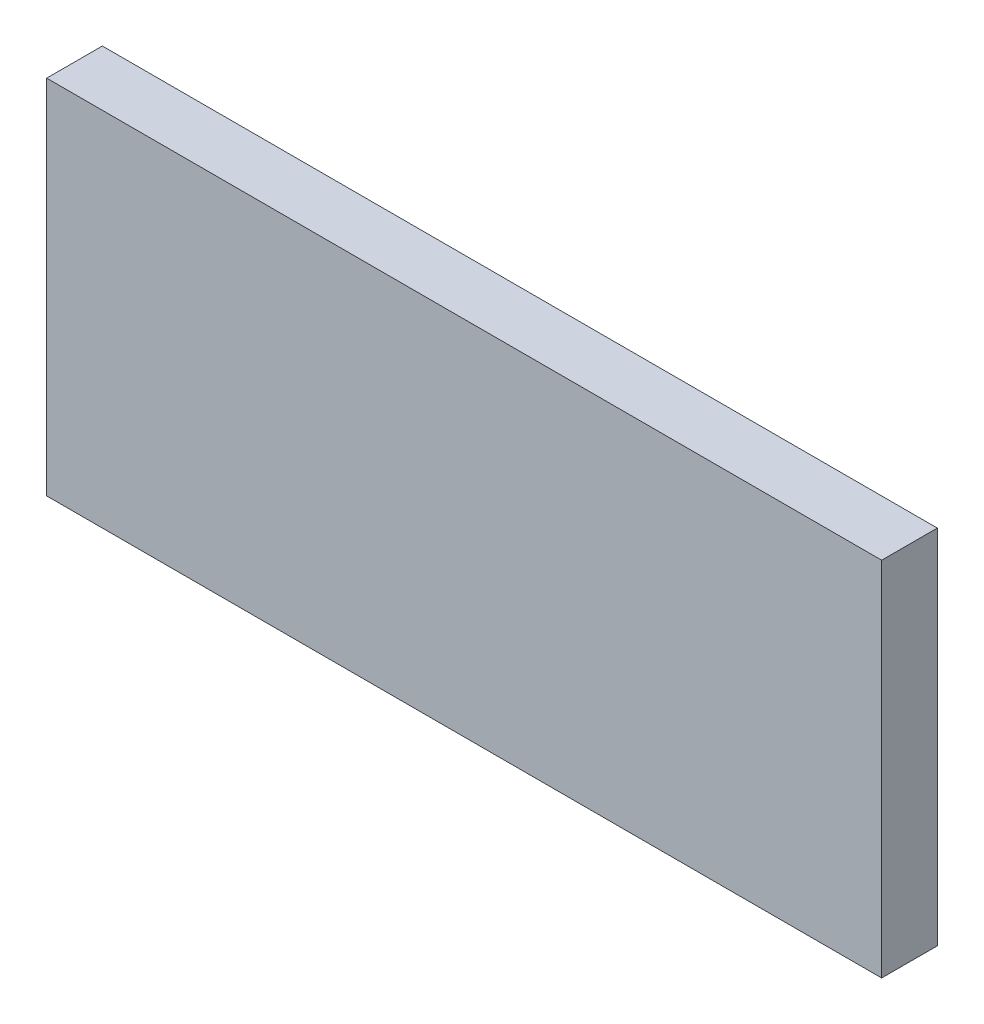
from build123d import *

# Parameters (mm, degrees)
SKIZZE1_W                       = 300
SKIZZE1_H                       = 20
AUFSATZ_LINEAR_AUSTRAGEN1_DEPTH = 130


with BuildPart() as part:
    # Skizze1 → Aufsatz-Linear austragen1 (new body)
    with BuildSketch(Plane(origin=(0, 0, 0), x_dir=(1, 0, 0), z_dir=(0, 1, 0))):
        with Locations((-150, -10)):
            Rectangle(SKIZZE1_W, SKIZZE1_H)
    extrude(amount=AUFSATZ_LINEAR_AUSTRAGEN1_DEPTH)


solid = part.part
